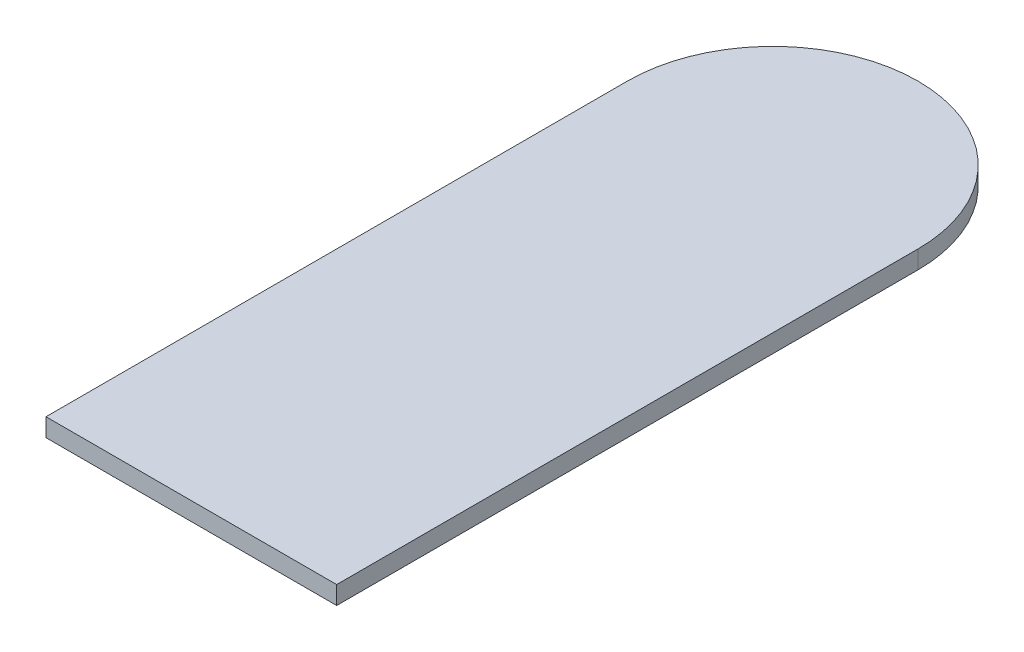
ISO-10303-21;
HEADER;
FILE_DESCRIPTION(('STEP AP214'),'2;1');
FILE_NAME('part.step','',(''),(''),'','','');
FILE_SCHEMA(('AUTOMOTIVE_DESIGN { 1 0 10303 214 1 1 1 1 }'));
ENDSEC;
DATA;
#1=APPLICATION_CONTEXT('core data for automotive mechanical design processes');
#2=APPLICATION_PROTOCOL_DEFINITION('international standard','automotive_design',2000,#1);
#3=PRODUCT_CONTEXT('',#1,'mechanical');
#4=PRODUCT('Part','Part','',(#3));
#5=PRODUCT_RELATED_PRODUCT_CATEGORY('part','',(#4));
#6=PRODUCT_DEFINITION_FORMATION('','',#4);
#7=PRODUCT_DEFINITION_CONTEXT('part definition',#1,'design');
#8=PRODUCT_DEFINITION('design','',#6,#7);
#9=PRODUCT_DEFINITION_SHAPE('','',#8);
#10=(LENGTH_UNIT() NAMED_UNIT(*) SI_UNIT(.MILLI.,.METRE.));
#11=(NAMED_UNIT(*) PLANE_ANGLE_UNIT() SI_UNIT($,.RADIAN.));
#12=(NAMED_UNIT(*) SI_UNIT($,.STERADIAN.) SOLID_ANGLE_UNIT());
#13=UNCERTAINTY_MEASURE_WITH_UNIT(LENGTH_MEASURE(1.E-05),#10,'distance_accuracy_value','');
#14=(GEOMETRIC_REPRESENTATION_CONTEXT(3) GLOBAL_UNCERTAINTY_ASSIGNED_CONTEXT((#13)) GLOBAL_UNIT_ASSIGNED_CONTEXT((#10,
#11,#12)) REPRESENTATION_CONTEXT('',''));
#15=CARTESIAN_POINT('',(0.,0.,0.));
#16=DIRECTION('',(0.,0.,1.));
#17=DIRECTION('',(1.,0.,0.));
#18=AXIS2_PLACEMENT_3D('',#15,#16,#17);
#19=CARTESIAN_POINT('',(0.,3.175,-50.8));
#20=DIRECTION('',(0.,-1.,0.));
#21=DIRECTION('',(0.,0.,-1.));
#22=AXIS2_PLACEMENT_3D('',#19,#20,#21);
#23=CYLINDRICAL_SURFACE('',#22,25.4);
#24=CARTESIAN_POINT('',(0.,0.,-50.8));
#25=DIRECTION('',(0.,1.,0.));
#26=DIRECTION('',(0.,0.,-1.));
#27=AXIS2_PLACEMENT_3D('',#24,#25,#26);
#28=CIRCLE('',#27,25.4);
#29=CARTESIAN_POINT('',(25.4,0.,-50.8));
#30=VERTEX_POINT('',#29);
#31=CARTESIAN_POINT('',(-25.4,0.,-50.8));
#32=VERTEX_POINT('',#31);
#33=EDGE_CURVE('E96',#30,#32,#28,.T.);
#34=ORIENTED_EDGE('',*,*,#33,.T.);
#35=DIRECTION('',(0.,-1.,0.));
#36=VECTOR('',#35,1.);
#37=CARTESIAN_POINT('',(-25.4,3.175,-50.8));
#38=LINE('',#37,#36);
#39=CARTESIAN_POINT('',(-25.4,3.175,-50.8));
#40=VERTEX_POINT('',#39);
#41=EDGE_CURVE('E11',#40,#32,#38,.T.);
#42=ORIENTED_EDGE('',*,*,#41,.F.);
#43=CARTESIAN_POINT('',(0.,3.175,-50.8));
#44=DIRECTION('',(0.,1.,0.));
#45=DIRECTION('',(0.,0.,-1.));
#46=AXIS2_PLACEMENT_3D('',#43,#44,#45);
#47=CIRCLE('',#46,25.4);
#48=CARTESIAN_POINT('',(25.4,3.175,-50.8));
#49=VERTEX_POINT('',#48);
#50=EDGE_CURVE('E84',#49,#40,#47,.T.);
#51=ORIENTED_EDGE('',*,*,#50,.F.);
#52=DIRECTION('',(0.,-1.,0.));
#53=VECTOR('',#52,1.);
#54=CARTESIAN_POINT('',(25.4,3.175,-50.8));
#55=LINE('',#54,#53);
#56=EDGE_CURVE('E92',#49,#30,#55,.T.);
#57=ORIENTED_EDGE('',*,*,#56,.T.);
#58=EDGE_LOOP('',(#34,#42,#51,#57));
#59=FACE_BOUND('',#58,.T.);
#60=ADVANCED_FACE('F33',(#59),#23,.T.);
#61=CARTESIAN_POINT('',(-25.4,3.175,50.8));
#62=DIRECTION('',(1.,0.,0.));
#63=DIRECTION('',(0.,0.,-1.));
#64=AXIS2_PLACEMENT_3D('',#61,#62,#63);
#65=PLANE('',#64);
#66=DIRECTION('',(0.,0.,1.));
#67=VECTOR('',#66,1.);
#68=CARTESIAN_POINT('',(-25.4,0.,50.8));
#69=LINE('',#68,#67);
#70=CARTESIAN_POINT('',(-25.4,0.,50.8));
#71=VERTEX_POINT('',#70);
#72=EDGE_CURVE('E88',#32,#71,#69,.T.);
#73=ORIENTED_EDGE('',*,*,#72,.T.);
#74=DIRECTION('',(0.,-1.,0.));
#75=VECTOR('',#74,1.);
#76=CARTESIAN_POINT('',(-25.4,3.175,50.8));
#77=LINE('',#76,#75);
#78=CARTESIAN_POINT('',(-25.4,3.175,50.8));
#79=VERTEX_POINT('',#78);
#80=EDGE_CURVE('E41',#79,#71,#77,.T.);
#81=ORIENTED_EDGE('',*,*,#80,.F.);
#82=DIRECTION('',(0.,0.,1.));
#83=VECTOR('',#82,1.);
#84=CARTESIAN_POINT('',(-25.4,3.175,50.8));
#85=LINE('',#84,#83);
#86=EDGE_CURVE('E79',#40,#79,#85,.T.);
#87=ORIENTED_EDGE('',*,*,#86,.F.);
#88=ORIENTED_EDGE('',*,*,#41,.T.);
#89=EDGE_LOOP('',(#73,#81,#87,#88));
#90=FACE_BOUND('',#89,.T.);
#91=ADVANCED_FACE('F87',(#90),#65,.F.);
#92=CARTESIAN_POINT('',(-25.4,3.175,50.8));
#93=DIRECTION('',(0.,0.,-1.));
#94=DIRECTION('',(-1.,0.,0.));
#95=AXIS2_PLACEMENT_3D('',#92,#93,#94);
#96=PLANE('',#95);
#97=DIRECTION('',(1.,0.,0.));
#98=VECTOR('',#97,1.);
#99=CARTESIAN_POINT('',(-25.4,0.,50.8));
#100=LINE('',#99,#98);
#101=CARTESIAN_POINT('',(25.4,0.,50.8));
#102=VERTEX_POINT('',#101);
#103=EDGE_CURVE('E66',#71,#102,#100,.T.);
#104=ORIENTED_EDGE('',*,*,#103,.T.);
#105=DIRECTION('',(0.,-1.,0.));
#106=VECTOR('',#105,1.);
#107=CARTESIAN_POINT('',(25.4,3.175,50.8));
#108=LINE('',#107,#106);
#109=CARTESIAN_POINT('',(25.4,3.175,50.8));
#110=VERTEX_POINT('',#109);
#111=EDGE_CURVE('E89',#110,#102,#108,.T.);
#112=ORIENTED_EDGE('',*,*,#111,.F.);
#113=DIRECTION('',(1.,0.,0.));
#114=VECTOR('',#113,1.);
#115=CARTESIAN_POINT('',(-25.4,3.175,50.8));
#116=LINE('',#115,#114);
#117=EDGE_CURVE('E82',#79,#110,#116,.T.);
#118=ORIENTED_EDGE('',*,*,#117,.F.);
#119=ORIENTED_EDGE('',*,*,#80,.T.);
#120=EDGE_LOOP('',(#104,#112,#118,#119));
#121=FACE_BOUND('',#120,.T.);
#122=ADVANCED_FACE('F90',(#121),#96,.F.);
#123=CARTESIAN_POINT('',(25.4,3.175,50.8));
#124=DIRECTION('',(-1.,0.,0.));
#125=DIRECTION('',(0.,0.,1.));
#126=AXIS2_PLACEMENT_3D('',#123,#124,#125);
#127=PLANE('',#126);
#128=DIRECTION('',(0.,0.,-1.));
#129=VECTOR('',#128,1.);
#130=CARTESIAN_POINT('',(25.4,0.,50.8));
#131=LINE('',#130,#129);
#132=EDGE_CURVE('E72',#102,#30,#131,.T.);
#133=ORIENTED_EDGE('',*,*,#132,.T.);
#134=ORIENTED_EDGE('',*,*,#56,.F.);
#135=DIRECTION('',(0.,0.,-1.));
#136=VECTOR('',#135,1.);
#137=CARTESIAN_POINT('',(25.4,3.175,50.8));
#138=LINE('',#137,#136);
#139=EDGE_CURVE('E49',#110,#49,#138,.T.);
#140=ORIENTED_EDGE('',*,*,#139,.F.);
#141=ORIENTED_EDGE('',*,*,#111,.T.);
#142=EDGE_LOOP('',(#133,#134,#140,#141));
#143=FACE_BOUND('',#142,.T.);
#144=ADVANCED_FACE('F103',(#143),#127,.F.);
#145=CARTESIAN_POINT('',(0.,3.175,-50.8));
#146=DIRECTION('',(0.,-1.,0.));
#147=DIRECTION('',(0.,0.,-1.));
#148=AXIS2_PLACEMENT_3D('',#145,#146,#147);
#149=PLANE('',#148);
#150=ORIENTED_EDGE('',*,*,#50,.T.);
#151=ORIENTED_EDGE('',*,*,#86,.T.);
#152=ORIENTED_EDGE('',*,*,#117,.T.);
#153=ORIENTED_EDGE('',*,*,#139,.T.);
#154=EDGE_LOOP('',(#150,#151,#152,#153));
#155=FACE_BOUND('',#154,.T.);
#156=ADVANCED_FACE('F80',(#155),#149,.F.);
#157=CARTESIAN_POINT('',(0.,0.,-50.8));
#158=DIRECTION('',(0.,-1.,0.));
#159=DIRECTION('',(0.,0.,-1.));
#160=AXIS2_PLACEMENT_3D('',#157,#158,#159);
#161=PLANE('',#160);
#162=ORIENTED_EDGE('',*,*,#33,.F.);
#163=ORIENTED_EDGE('',*,*,#132,.F.);
#164=ORIENTED_EDGE('',*,*,#103,.F.);
#165=ORIENTED_EDGE('',*,*,#72,.F.);
#166=EDGE_LOOP('',(#162,#163,#164,#165));
#167=FACE_BOUND('',#166,.T.);
#168=ADVANCED_FACE('F106',(#167),#161,.T.);
#169=CLOSED_SHELL('',(#60,#91,#122,#144,#156,#168));
#170=MANIFOLD_SOLID_BREP('B2',#169);
#171=ADVANCED_BREP_SHAPE_REPRESENTATION('',(#18,#170),#14);
#172=SHAPE_DEFINITION_REPRESENTATION(#9,#171);
ENDSEC;
END-ISO-10303-21;
